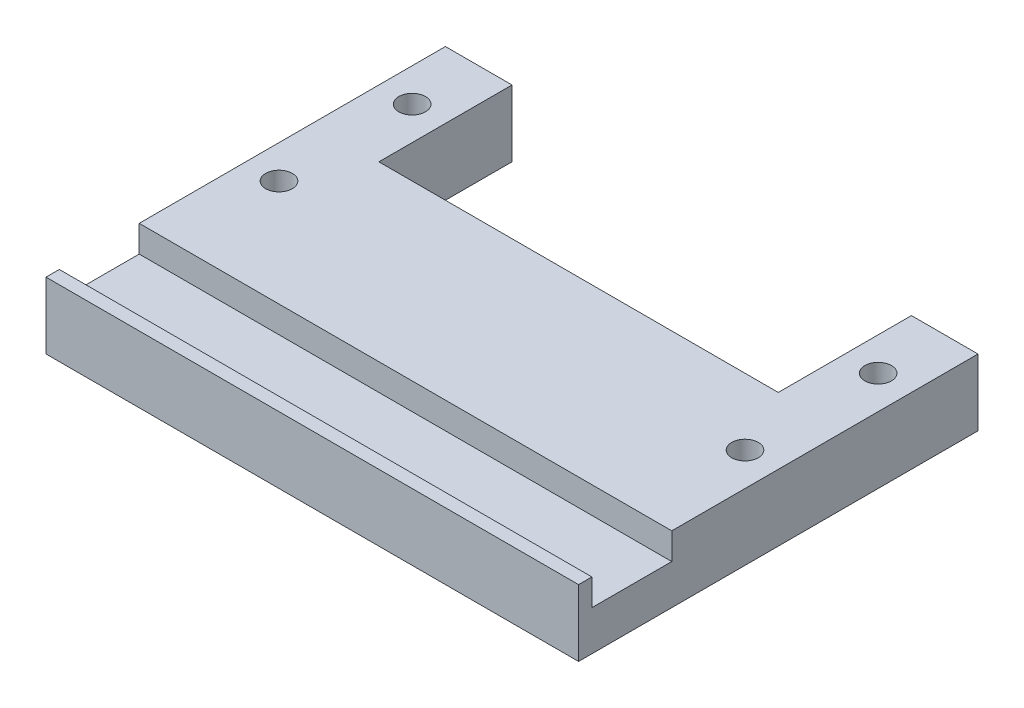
from build123d import *

# Parameters (mm, degrees)
SKETCH1_W           = 50.8
SKETCH1_H           = 25.4
BOSS_EXTRUDE1_DEPTH = 6.35
SKETCH3_W           = 6.35
SKETCH3_H           = 6.35
BOSS_EXTRUDE2_DEPTH = 12.7
SKETCH5_R           = 1.27
CUT_EXTRUDE3_DEPTH  = 37.477972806
SKETCH2_W           = 54.649081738
SKETCH2_H           = 7.62
CUT_EXTRUDE4_DEPTH  = 2.54
SKETCH7_W           = 40.64
SKETCH7_H           = 13.97
CUT_EXTRUDE5_DEPTH  = 5.08


with BuildPart() as part:
    # Sketch1 → Boss-Extrude1 (new body)
    with BuildSketch(Plane(origin=(0, 0, 0), x_dir=(1, 0, 0), z_dir=(0, 1, 0))):
        Rectangle(SKETCH1_W, SKETCH1_H)
    extrude(amount=BOSS_EXTRUDE1_DEPTH)

    # Sketch3 → Boss-Extrude2 (add)
    with BuildSketch(Plane(origin=(0, 0, -12.7), x_dir=(-1, 0, 0), z_dir=(0, 0, -1))):
        with Locations((-22.225, 3.175)):
            Rectangle(SKETCH3_W, SKETCH3_H)
        with Locations((22.225, 3.175)):
            Rectangle(SKETCH3_W, SKETCH3_H)
    extrude(amount=BOSS_EXTRUDE2_DEPTH)

    # Sketch5 → Cut-Extrude3 (cut, through all)
    with BuildSketch(Plane(origin=(0, 6.35, 0), x_dir=(1, 0, 0), z_dir=(0, 1, 0))):
        with Locations(Location((-22.225, 6.35, 0), (0, 0, 270))):
            Circle(SKETCH5_R)
        with Locations(Location((-22.225, 19.05, 0), (0, 0, 270))):
            Circle(SKETCH5_R)
        with Locations(Location((22.225, 6.35, 0), (0, 0, 90))):
            Circle(SKETCH5_R)
        with Locations(Location((22.225, 19.05, 0), (0, 0, 90))):
            Circle(SKETCH5_R)
    extrude(amount=-CUT_EXTRUDE3_DEPTH, mode=Mode.SUBTRACT)

    # Sketch2 → Cut-Extrude4 (cut)
    with BuildSketch(Plane(origin=(0, 6.35, 0), x_dir=(1, 0, 0), z_dir=(0, 1, 0))):
        with Locations((0, -7.62)):
            Rectangle(SKETCH2_W, SKETCH2_H)
    extrude(amount=-CUT_EXTRUDE4_DEPTH, mode=Mode.SUBTRACT)

    # Sketch7 → Cut-Extrude5 (cut)
    with BuildSketch(Plane.XZ):
        with Locations((0, -4.445)):
            Rectangle(SKETCH7_W, SKETCH7_H)
    extrude(amount=-CUT_EXTRUDE5_DEPTH, mode=Mode.SUBTRACT)


solid = part.part
